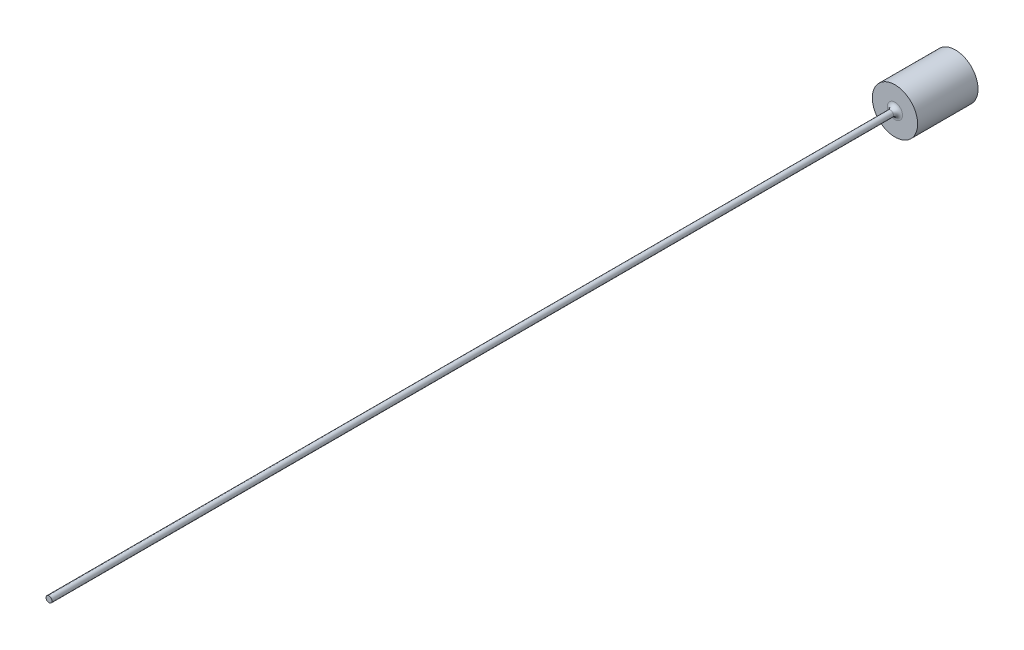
ISO-10303-21;
HEADER;
FILE_DESCRIPTION(('STEP AP214'),'2;1');
FILE_NAME('part.step','',(''),(''),'','','');
FILE_SCHEMA(('AUTOMOTIVE_DESIGN { 1 0 10303 214 1 1 1 1 }'));
ENDSEC;
DATA;
#1=APPLICATION_CONTEXT('core data for automotive mechanical design processes');
#2=APPLICATION_PROTOCOL_DEFINITION('international standard','automotive_design',2000,#1);
#3=PRODUCT_CONTEXT('',#1,'mechanical');
#4=PRODUCT('Part','Part','',(#3));
#5=PRODUCT_RELATED_PRODUCT_CATEGORY('part','',(#4));
#6=PRODUCT_DEFINITION_FORMATION('','',#4);
#7=PRODUCT_DEFINITION_CONTEXT('part definition',#1,'design');
#8=PRODUCT_DEFINITION('design','',#6,#7);
#9=PRODUCT_DEFINITION_SHAPE('','',#8);
#10=(LENGTH_UNIT() NAMED_UNIT(*) SI_UNIT(.MILLI.,.METRE.));
#11=(NAMED_UNIT(*) PLANE_ANGLE_UNIT() SI_UNIT($,.RADIAN.));
#12=(NAMED_UNIT(*) SI_UNIT($,.STERADIAN.) SOLID_ANGLE_UNIT());
#13=UNCERTAINTY_MEASURE_WITH_UNIT(LENGTH_MEASURE(1.E-05),#10,'distance_accuracy_value','');
#14=(GEOMETRIC_REPRESENTATION_CONTEXT(3) GLOBAL_UNCERTAINTY_ASSIGNED_CONTEXT((#13)) GLOBAL_UNIT_ASSIGNED_CONTEXT((#10,
#11,#12)) REPRESENTATION_CONTEXT('',''));
#15=CARTESIAN_POINT('',(0.,0.,0.));
#16=DIRECTION('',(0.,0.,1.));
#17=DIRECTION('',(1.,0.,0.));
#18=AXIS2_PLACEMENT_3D('',#15,#16,#17);
#19=CARTESIAN_POINT('',(1.5,0.,4.));
#20=DIRECTION('',(0.,0.,-1.));
#21=DIRECTION('',(-1.,0.,0.));
#22=AXIS2_PLACEMENT_3D('',#19,#20,#21);
#23=PLANE('',#22);
#24=CARTESIAN_POINT('',(0.,0.,4.));
#25=DIRECTION('',(0.,0.,-1.));
#26=DIRECTION('',(-1.,0.,0.));
#27=AXIS2_PLACEMENT_3D('',#24,#25,#26);
#28=CIRCLE('',#27,0.500000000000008);
#29=CARTESIAN_POINT('',(-0.500000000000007,0.,4.));
#30=VERTEX_POINT('',#29);
#31=EDGE_CURVE('E38',#30,#30,#28,.T.);
#32=ORIENTED_EDGE('',*,*,#31,.T.);
#33=EDGE_LOOP('',(#32));
#34=FACE_BOUND('',#33,.T.);
#35=CARTESIAN_POINT('',(0.,0.,4.));
#36=DIRECTION('',(0.,0.,-1.));
#37=DIRECTION('',(-1.,0.,0.));
#38=AXIS2_PLACEMENT_3D('',#35,#36,#37);
#39=CIRCLE('',#38,1.5);
#40=CARTESIAN_POINT('',(-1.5,0.,4.));
#41=VERTEX_POINT('',#40);
#42=EDGE_CURVE('E42',#41,#41,#39,.T.);
#43=ORIENTED_EDGE('',*,*,#42,.F.);
#44=EDGE_LOOP('',(#43));
#45=FACE_BOUND('',#44,.T.);
#46=ADVANCED_FACE('F31',(#34,#45),#23,.F.);
#47=CARTESIAN_POINT('',(0.,0.,-9.03322817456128));
#48=DIRECTION('',(0.,0.,-1.));
#49=DIRECTION('',(-1.,0.,0.));
#50=AXIS2_PLACEMENT_3D('',#47,#48,#49);
#51=CYLINDRICAL_SURFACE('',#50,1.5);
#52=CARTESIAN_POINT('',(0.,0.,0.));
#53=DIRECTION('',(0.,0.,-1.));
#54=DIRECTION('',(-1.,0.,0.));
#55=AXIS2_PLACEMENT_3D('',#52,#53,#54);
#56=CIRCLE('',#55,1.5);
#57=CARTESIAN_POINT('',(-1.5,0.,0.));
#58=VERTEX_POINT('',#57);
#59=EDGE_CURVE('E46',#58,#58,#56,.T.);
#60=ORIENTED_EDGE('',*,*,#59,.F.);
#61=EDGE_LOOP('',(#60));
#62=FACE_BOUND('',#61,.T.);
#63=ORIENTED_EDGE('',*,*,#42,.T.);
#64=EDGE_LOOP('',(#63));
#65=FACE_BOUND('',#64,.T.);
#66=ADVANCED_FACE('F66',(#62,#65),#51,.T.);
#67=CARTESIAN_POINT('',(0.,0.,0.));
#68=DIRECTION('',(0.,0.,1.));
#69=DIRECTION('',(1.,0.,0.));
#70=AXIS2_PLACEMENT_3D('',#67,#68,#69);
#71=PLANE('',#70);
#72=ORIENTED_EDGE('',*,*,#59,.T.);
#73=EDGE_LOOP('',(#72));
#74=FACE_BOUND('',#73,.T.);
#75=ADVANCED_FACE('F59',(#74),#71,.F.);
#76=CARTESIAN_POINT('',(0.,0.,60.));
#77=DIRECTION('',(0.,0.,-1.));
#78=DIRECTION('',(-1.,0.,0.));
#79=AXIS2_PLACEMENT_3D('',#76,#77,#78);
#80=PLANE('',#79);
#81=CARTESIAN_POINT('',(0.,0.,60.));
#82=DIRECTION('',(0.,0.,-1.));
#83=DIRECTION('',(-1.,0.,0.));
#84=AXIS2_PLACEMENT_3D('',#81,#82,#83);
#85=CIRCLE('',#84,0.200000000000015);
#86=CARTESIAN_POINT('',(-0.20000000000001,0.,60.));
#87=VERTEX_POINT('',#86);
#88=EDGE_CURVE('E51',#87,#87,#85,.T.);
#89=ORIENTED_EDGE('',*,*,#88,.F.);
#90=EDGE_LOOP('',(#89));
#91=FACE_BOUND('',#90,.T.);
#92=ADVANCED_FACE('F57',(#91),#80,.F.);
#93=CARTESIAN_POINT('',(0.,0.,-9.03322817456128));
#94=DIRECTION('',(0.,0.,-1.));
#95=DIRECTION('',(-1.,0.,0.));
#96=AXIS2_PLACEMENT_3D('',#93,#94,#95);
#97=CYLINDRICAL_SURFACE('',#96,0.200000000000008);
#98=CARTESIAN_POINT('',(0.,0.,4.3));
#99=DIRECTION('',(0.,0.,-1.));
#100=DIRECTION('',(-1.,0.,0.));
#101=AXIS2_PLACEMENT_3D('',#98,#99,#100);
#102=CIRCLE('',#101,0.200000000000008);
#103=CARTESIAN_POINT('',(-0.200000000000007,0.,4.3));
#104=VERTEX_POINT('',#103);
#105=EDGE_CURVE('E10',#104,#104,#102,.F.);
#106=ORIENTED_EDGE('',*,*,#105,.T.);
#107=EDGE_LOOP('',(#106));
#108=FACE_BOUND('',#107,.T.);
#109=ORIENTED_EDGE('',*,*,#88,.T.);
#110=EDGE_LOOP('',(#109));
#111=FACE_BOUND('',#110,.T.);
#112=ADVANCED_FACE('F55',(#108,#111),#97,.T.);
#113=CARTESIAN_POINT('',(0.,0.,4.3));
#114=DIRECTION('',(0.,0.,-1.));
#115=DIRECTION('',(-1.,0.,0.));
#116=AXIS2_PLACEMENT_3D('',#113,#114,#115);
#117=TOROIDAL_SURFACE('',#116,0.500000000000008,0.3);
#118=ORIENTED_EDGE('',*,*,#105,.F.);
#119=EDGE_LOOP('',(#118));
#120=FACE_BOUND('',#119,.T.);
#121=ORIENTED_EDGE('',*,*,#31,.F.);
#122=EDGE_LOOP('',(#121));
#123=FACE_BOUND('',#122,.T.);
#124=ADVANCED_FACE('F33',(#120,#123),#117,.F.);
#125=CLOSED_SHELL('',(#46,#66,#75,#92,#112,#124));
#126=MANIFOLD_SOLID_BREP('B2',#125);
#127=ADVANCED_BREP_SHAPE_REPRESENTATION('',(#18,#126),#14);
#128=SHAPE_DEFINITION_REPRESENTATION(#9,#127);
ENDSEC;
END-ISO-10303-21;
